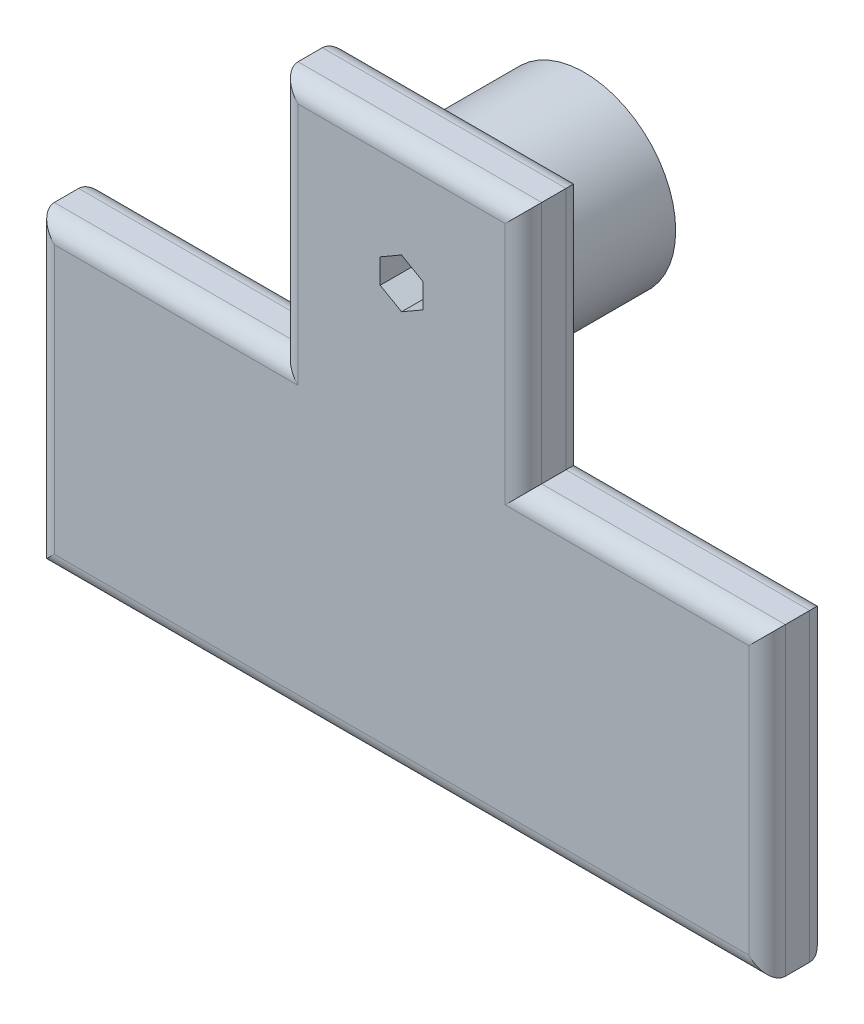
from build123d import *

# Parameters (mm, degrees)
BOSS_EXTRU_1_DEPTH      = 10
CONG_1_R                = 3
ESQUISSE2_R             = 15
BOSS_EXTRU_2_DEPTH      = 20
ENL_V_MAT_EXTRU_1_DEPTH = 20


with BuildPart() as part:
    # Esquisse1 → Boss.-Extru.1 (new body)
    with BuildSketch(Plane.XY):
        Polygon((-20, 20), (20, 20), (20, -20), (60, -20), (60, -70), (-60, -70), (-60, -20), (-20, -20), align=None)
        Polygon((0, -4.041451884), (3.5, -2.020725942), (3.5, 2.020725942), (0, 4.041451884), (-3.5, 2.020725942), (-3.5, -2.020725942), align=None, mode=Mode.SUBTRACT)
    extrude(amount=BOSS_EXTRU_1_DEPTH)

    # Cong_1
    cong_1_edges = [part.edges().sort_by_distance(p)[0] for p in [
        (0, 20, 0),
        (20, 0, 0),
        (40, -20, 0),
        (60, -45, 0),
        (20, 0, 10),
        (0, 20, 10),
        (-20, 0, 10),
        (-40, -20, 10),
        (-60, -45, 10),
        (0, -70, 10),
        (60, -45, 10),
        (0, -70, 0),
        (40, -20, 10),
        (-60, -45, 0),
        (-40, -20, 0),
        (-20, 0, 0),
    ]]
    fillet(cong_1_edges, radius=CONG_1_R)

    # Esquisse2 → Boss.-Extru.2 (add)
    with BuildSketch(Plane.XY):
        Circle(ESQUISSE2_R)
    extrude(amount=-BOSS_EXTRU_2_DEPTH)

    # Esquisse3 → Enl_v. mat.-Extru.1 (cut)
    with BuildSketch(Plane(origin=(0, 0, 0), x_dir=(-1, 0, 0), z_dir=(0, 0, -1))):
        Polygon((-3.5, 2.020725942), (-3.5, -2.020725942), (0, -4.041451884), (3.5, -2.020725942), (3.5, 2.020725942), (0, 4.041451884), align=None)
    extrude(amount=ENL_V_MAT_EXTRU_1_DEPTH, mode=Mode.SUBTRACT)


solid = part.part
